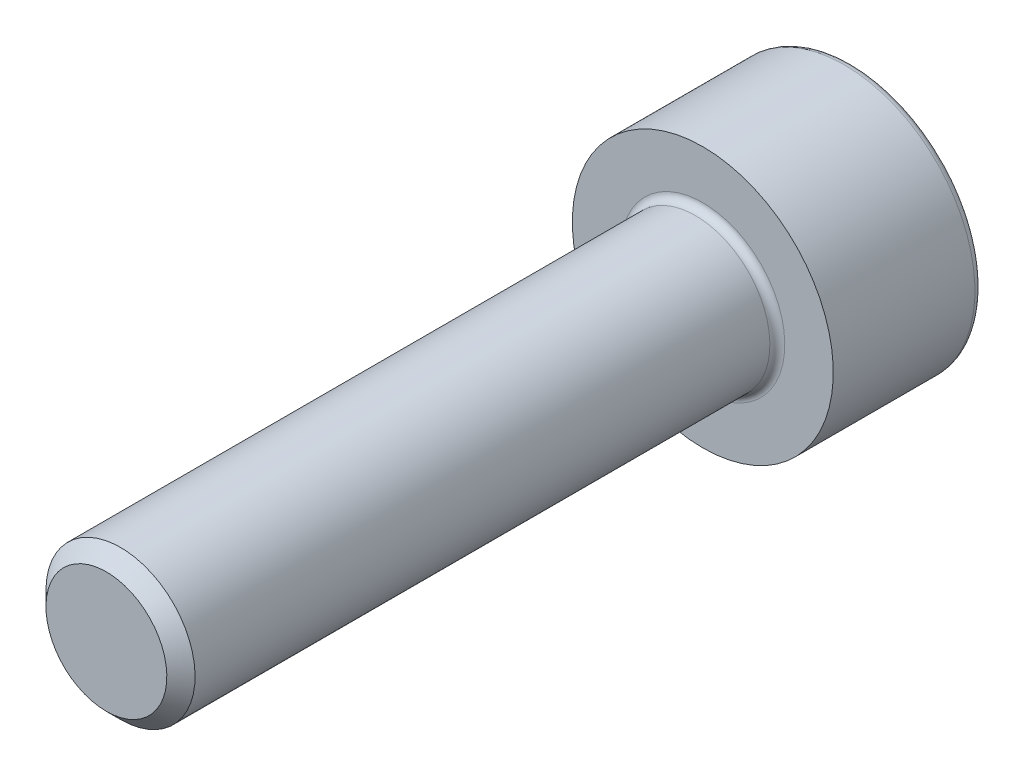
ISO-10303-21;
HEADER;
FILE_DESCRIPTION(('STEP AP214'),'2;1');
FILE_NAME('part.step','',(''),(''),'','','');
FILE_SCHEMA(('AUTOMOTIVE_DESIGN { 1 0 10303 214 1 1 1 1 }'));
ENDSEC;
DATA;
#1=APPLICATION_CONTEXT('core data for automotive mechanical design processes');
#2=APPLICATION_PROTOCOL_DEFINITION('international standard','automotive_design',2000,#1);
#3=PRODUCT_CONTEXT('',#1,'mechanical');
#4=PRODUCT('Part','Part','',(#3));
#5=PRODUCT_RELATED_PRODUCT_CATEGORY('part','',(#4));
#6=PRODUCT_DEFINITION_FORMATION('','',#4);
#7=PRODUCT_DEFINITION_CONTEXT('part definition',#1,'design');
#8=PRODUCT_DEFINITION('design','',#6,#7);
#9=PRODUCT_DEFINITION_SHAPE('','',#8);
#10=(LENGTH_UNIT() NAMED_UNIT(*) SI_UNIT(.MILLI.,.METRE.));
#11=(NAMED_UNIT(*) PLANE_ANGLE_UNIT() SI_UNIT($,.RADIAN.));
#12=(NAMED_UNIT(*) SI_UNIT($,.STERADIAN.) SOLID_ANGLE_UNIT());
#13=UNCERTAINTY_MEASURE_WITH_UNIT(LENGTH_MEASURE(1.E-05),#10,'distance_accuracy_value','');
#14=(GEOMETRIC_REPRESENTATION_CONTEXT(3) GLOBAL_UNCERTAINTY_ASSIGNED_CONTEXT((#13)) GLOBAL_UNIT_ASSIGNED_CONTEXT((#10,
#11,#12)) REPRESENTATION_CONTEXT('',''));
#15=CARTESIAN_POINT('',(0.,0.,0.));
#16=DIRECTION('',(0.,0.,1.));
#17=DIRECTION('',(1.,0.,0.));
#18=AXIS2_PLACEMENT_3D('',#15,#16,#17);
#19=CARTESIAN_POINT('',(0.,2.,16.));
#20=DIRECTION('',(0.,0.,1.));
#21=DIRECTION('',(0.,-1.,0.));
#22=AXIS2_PLACEMENT_3D('',#19,#20,#21);
#23=PLANE('',#22);
#24=CARTESIAN_POINT('',(0.,0.,16.));
#25=DIRECTION('',(0.,0.,1.));
#26=DIRECTION('',(0.,-1.,0.));
#27=AXIS2_PLACEMENT_3D('',#24,#25,#26);
#28=CIRCLE('',#27,1.621125);
#29=CARTESIAN_POINT('',(0.,-1.621125,16.));
#30=VERTEX_POINT('',#29);
#31=EDGE_CURVE('E11',#30,#30,#28,.T.);
#32=ORIENTED_EDGE('',*,*,#31,.T.);
#33=EDGE_LOOP('',(#32));
#34=FACE_BOUND('',#33,.T.);
#35=ADVANCED_FACE('F33',(#34),#23,.T.);
#36=CARTESIAN_POINT('',(0.,0.,-4.));
#37=DIRECTION('',(0.,0.,-1.));
#38=DIRECTION('',(0.,1.,0.));
#39=AXIS2_PLACEMENT_3D('',#36,#37,#38);
#40=CYLINDRICAL_SURFACE('',#39,2.);
#41=CARTESIAN_POINT('',(0.,0.,15.621125));
#42=DIRECTION('',(0.,0.,1.));
#43=DIRECTION('',(0.,-1.,0.));
#44=AXIS2_PLACEMENT_3D('',#41,#42,#43);
#45=CIRCLE('',#44,2.);
#46=CARTESIAN_POINT('',(0.,-2.,15.621125));
#47=VERTEX_POINT('',#46);
#48=EDGE_CURVE('E40',#47,#47,#45,.F.);
#49=ORIENTED_EDGE('',*,*,#48,.T.);
#50=EDGE_LOOP('',(#49));
#51=FACE_BOUND('',#50,.T.);
#52=CARTESIAN_POINT('',(0.,0.,0.2));
#53=DIRECTION('',(0.,0.,1.));
#54=DIRECTION('',(0.,-1.,0.));
#55=AXIS2_PLACEMENT_3D('',#52,#53,#54);
#56=CIRCLE('',#55,2.);
#57=CARTESIAN_POINT('',(0.,-2.,0.199999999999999));
#58=VERTEX_POINT('',#57);
#59=EDGE_CURVE('E183',#58,#58,#56,.T.);
#60=ORIENTED_EDGE('',*,*,#59,.T.);
#61=EDGE_LOOP('',(#60));
#62=FACE_BOUND('',#61,.T.);
#63=ADVANCED_FACE('F194',(#51,#62),#40,.T.);
#64=CARTESIAN_POINT('',(0.,3.5,0.));
#65=DIRECTION('',(0.,0.,1.));
#66=DIRECTION('',(0.,-1.,0.));
#67=AXIS2_PLACEMENT_3D('',#64,#65,#66);
#68=PLANE('',#67);
#69=CARTESIAN_POINT('',(0.,0.,0.));
#70=DIRECTION('',(0.,0.,1.));
#71=DIRECTION('',(0.,-1.,0.));
#72=AXIS2_PLACEMENT_3D('',#69,#70,#71);
#73=CIRCLE('',#72,2.2);
#74=CARTESIAN_POINT('',(0.,-2.2,0.));
#75=VERTEX_POINT('',#74);
#76=EDGE_CURVE('E180',#75,#75,#73,.F.);
#77=ORIENTED_EDGE('',*,*,#76,.T.);
#78=EDGE_LOOP('',(#77));
#79=FACE_BOUND('',#78,.T.);
#80=CARTESIAN_POINT('',(0.,0.,0.));
#81=DIRECTION('',(0.,0.,-1.));
#82=DIRECTION('',(0.,1.,0.));
#83=AXIS2_PLACEMENT_3D('',#80,#81,#82);
#84=CIRCLE('',#83,3.5);
#85=CARTESIAN_POINT('',(0.,3.5,0.));
#86=VERTEX_POINT('',#85);
#87=EDGE_CURVE('E176',#86,#86,#84,.T.);
#88=ORIENTED_EDGE('',*,*,#87,.F.);
#89=EDGE_LOOP('',(#88));
#90=FACE_BOUND('',#89,.T.);
#91=ADVANCED_FACE('F214',(#79,#90),#68,.T.);
#92=CARTESIAN_POINT('',(0.,0.,-4.));
#93=DIRECTION('',(0.,0.,-1.));
#94=DIRECTION('',(0.,1.,0.));
#95=AXIS2_PLACEMENT_3D('',#92,#93,#94);
#96=CYLINDRICAL_SURFACE('',#95,3.5);
#97=CARTESIAN_POINT('',(0.,0.,-3.8));
#98=DIRECTION('',(0.,0.,-1.));
#99=DIRECTION('',(0.,1.,0.));
#100=AXIS2_PLACEMENT_3D('',#97,#98,#99);
#101=CIRCLE('',#100,3.5);
#102=CARTESIAN_POINT('',(0.,3.5,-3.8));
#103=VERTEX_POINT('',#102);
#104=EDGE_CURVE('E189',#103,#103,#101,.F.);
#105=ORIENTED_EDGE('',*,*,#104,.T.);
#106=EDGE_LOOP('',(#105));
#107=FACE_BOUND('',#106,.T.);
#108=ORIENTED_EDGE('',*,*,#87,.T.);
#109=EDGE_LOOP('',(#108));
#110=FACE_BOUND('',#109,.T.);
#111=ADVANCED_FACE('F218',(#107,#110),#96,.T.);
#112=CARTESIAN_POINT('',(0.,0.,-4.));
#113=DIRECTION('',(0.,0.,-1.));
#114=DIRECTION('',(0.,1.,0.));
#115=AXIS2_PLACEMENT_3D('',#112,#113,#114);
#116=PLANE('',#115);
#117=CARTESIAN_POINT('',(0.,0.,-4.));
#118=DIRECTION('',(0.,0.,-1.));
#119=DIRECTION('',(0.,1.,0.));
#120=AXIS2_PLACEMENT_3D('',#117,#118,#119);
#121=CIRCLE('',#120,3.3);
#122=CARTESIAN_POINT('',(0.,3.3,-4.));
#123=VERTEX_POINT('',#122);
#124=EDGE_CURVE('E186',#123,#123,#121,.T.);
#125=ORIENTED_EDGE('',*,*,#124,.T.);
#126=EDGE_LOOP('',(#125));
#127=FACE_BOUND('',#126,.T.);
#128=DIRECTION('',(-1.,0.,0.));
#129=VECTOR('',#128,1.);
#130=CARTESIAN_POINT('',(0.866025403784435,-1.5,-4.));
#131=LINE('',#130,#129);
#132=CARTESIAN_POINT('',(0.866025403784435,-1.5,-4.));
#133=VERTEX_POINT('',#132);
#134=CARTESIAN_POINT('',(-0.86602540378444,-1.5,-4.));
#135=VERTEX_POINT('',#134);
#136=EDGE_CURVE('E138',#133,#135,#131,.T.);
#137=ORIENTED_EDGE('',*,*,#136,.F.);
#138=DIRECTION('',(-0.499999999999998,-0.86602540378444,0.));
#139=VECTOR('',#138,1.);
#140=CARTESIAN_POINT('',(1.73205080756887,0.,-4.));
#141=LINE('',#140,#139);
#142=CARTESIAN_POINT('',(1.73205080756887,0.,-4.));
#143=VERTEX_POINT('',#142);
#144=EDGE_CURVE('E133',#143,#133,#141,.T.);
#145=ORIENTED_EDGE('',*,*,#144,.F.);
#146=DIRECTION('',(0.499999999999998,-0.86602540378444,0.));
#147=VECTOR('',#146,1.);
#148=CARTESIAN_POINT('',(0.866025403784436,1.5,-4.));
#149=LINE('',#148,#147);
#150=CARTESIAN_POINT('',(0.866025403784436,1.5,-4.));
#151=VERTEX_POINT('',#150);
#152=EDGE_CURVE('E131',#151,#143,#149,.T.);
#153=ORIENTED_EDGE('',*,*,#152,.F.);
#154=DIRECTION('',(1.,0.,0.));
#155=VECTOR('',#154,1.);
#156=CARTESIAN_POINT('',(-0.866025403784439,1.5,-4.));
#157=LINE('',#156,#155);
#158=CARTESIAN_POINT('',(-0.866025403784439,1.5,-4.));
#159=VERTEX_POINT('',#158);
#160=EDGE_CURVE('E116',#159,#151,#157,.T.);
#161=ORIENTED_EDGE('',*,*,#160,.F.);
#162=DIRECTION('',(0.499999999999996,0.866025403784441,0.));
#163=VECTOR('',#162,1.);
#164=CARTESIAN_POINT('',(-1.73205080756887,0.,-4.));
#165=LINE('',#164,#163);
#166=CARTESIAN_POINT('',(-1.73205080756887,0.,-4.));
#167=VERTEX_POINT('',#166);
#168=EDGE_CURVE('E104',#167,#159,#165,.T.);
#169=ORIENTED_EDGE('',*,*,#168,.F.);
#170=DIRECTION('',(-0.499999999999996,0.866025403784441,0.));
#171=VECTOR('',#170,1.);
#172=CARTESIAN_POINT('',(-0.86602540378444,-1.5,-4.));
#173=LINE('',#172,#171);
#174=EDGE_CURVE('E140',#135,#167,#173,.T.);
#175=ORIENTED_EDGE('',*,*,#174,.F.);
#176=EDGE_LOOP('',(#137,#145,#153,#161,#169,#175));
#177=FACE_BOUND('',#176,.T.);
#178=ADVANCED_FACE('F129',(#127,#177),#116,.T.);
#179=CARTESIAN_POINT('',(-1.73205080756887,0.,-2.));
#180=DIRECTION('',(-0.866025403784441,0.499999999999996,0.));
#181=DIRECTION('',(-0.499999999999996,-0.866025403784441,0.));
#182=AXIS2_PLACEMENT_3D('',#179,#180,#181);
#183=PLANE('',#182);
#184=ORIENTED_EDGE('',*,*,#168,.T.);
#185=DIRECTION('',(0.,0.,-1.));
#186=VECTOR('',#185,1.);
#187=CARTESIAN_POINT('',(-0.866025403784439,1.5,-2.));
#188=LINE('',#187,#186);
#189=CARTESIAN_POINT('',(-0.866025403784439,1.5,-2.));
#190=VERTEX_POINT('',#189);
#191=EDGE_CURVE('E108',#190,#159,#188,.T.);
#192=ORIENTED_EDGE('',*,*,#191,.F.);
#193=DIRECTION('',(0.499999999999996,0.866025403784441,0.));
#194=VECTOR('',#193,1.);
#195=CARTESIAN_POINT('',(-1.73205080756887,0.,-2.));
#196=LINE('',#195,#194);
#197=CARTESIAN_POINT('',(-1.29903810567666,0.749999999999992,-2.));
#198=VERTEX_POINT('',#197);
#199=EDGE_CURVE('E142',#198,#190,#196,.T.);
#200=ORIENTED_EDGE('',*,*,#199,.F.);
#201=CARTESIAN_POINT('',(-1.73205080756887,0.,-2.));
#202=VERTEX_POINT('',#201);
#203=EDGE_CURVE('E143',#202,#198,#196,.T.);
#204=ORIENTED_EDGE('',*,*,#203,.F.);
#205=DIRECTION('',(0.,0.,-1.));
#206=VECTOR('',#205,1.);
#207=CARTESIAN_POINT('',(-1.73205080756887,0.,-2.));
#208=LINE('',#207,#206);
#209=EDGE_CURVE('E112',#202,#167,#208,.T.);
#210=ORIENTED_EDGE('',*,*,#209,.T.);
#211=EDGE_LOOP('',(#184,#192,#200,#204,#210));
#212=FACE_BOUND('',#211,.T.);
#213=ADVANCED_FACE('F106',(#212),#183,.F.);
#214=CARTESIAN_POINT('',(-0.86602540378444,-1.5,-2.));
#215=DIRECTION('',(-0.866025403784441,-0.499999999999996,0.));
#216=DIRECTION('',(0.499999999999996,-0.866025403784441,0.));
#217=AXIS2_PLACEMENT_3D('',#214,#215,#216);
#218=PLANE('',#217);
#219=ORIENTED_EDGE('',*,*,#174,.T.);
#220=ORIENTED_EDGE('',*,*,#209,.F.);
#221=DIRECTION('',(-0.499999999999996,0.866025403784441,0.));
#222=VECTOR('',#221,1.);
#223=CARTESIAN_POINT('',(-0.86602540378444,-1.5,-2.));
#224=LINE('',#223,#222);
#225=CARTESIAN_POINT('',(-1.29903810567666,-0.749999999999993,-2.));
#226=VERTEX_POINT('',#225);
#227=EDGE_CURVE('E158',#226,#202,#224,.T.);
#228=ORIENTED_EDGE('',*,*,#227,.F.);
#229=CARTESIAN_POINT('',(-0.86602540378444,-1.5,-2.));
#230=VERTEX_POINT('',#229);
#231=EDGE_CURVE('E126',#230,#226,#224,.T.);
#232=ORIENTED_EDGE('',*,*,#231,.F.);
#233=DIRECTION('',(0.,0.,-1.));
#234=VECTOR('',#233,1.);
#235=CARTESIAN_POINT('',(-0.86602540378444,-1.5,-2.));
#236=LINE('',#235,#234);
#237=EDGE_CURVE('E163',#230,#135,#236,.T.);
#238=ORIENTED_EDGE('',*,*,#237,.T.);
#239=EDGE_LOOP('',(#219,#220,#228,#232,#238));
#240=FACE_BOUND('',#239,.T.);
#241=ADVANCED_FACE('F234',(#240),#218,.F.);
#242=CARTESIAN_POINT('',(0.866025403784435,-1.5,-2.));
#243=DIRECTION('',(0.,-1.,0.));
#244=DIRECTION('',(0.,0.,-1.));
#245=AXIS2_PLACEMENT_3D('',#242,#243,#244);
#246=PLANE('',#245);
#247=ORIENTED_EDGE('',*,*,#136,.T.);
#248=ORIENTED_EDGE('',*,*,#237,.F.);
#249=DIRECTION('',(-1.,0.,0.));
#250=VECTOR('',#249,1.);
#251=CARTESIAN_POINT('',(0.866025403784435,-1.5,-2.));
#252=LINE('',#251,#250);
#253=CARTESIAN_POINT('',(0.,-1.5,-2.));
#254=VERTEX_POINT('',#253);
#255=EDGE_CURVE('E156',#254,#230,#252,.T.);
#256=ORIENTED_EDGE('',*,*,#255,.F.);
#257=CARTESIAN_POINT('',(0.866025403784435,-1.5,-2.));
#258=VERTEX_POINT('',#257);
#259=EDGE_CURVE('E47',#258,#254,#252,.T.);
#260=ORIENTED_EDGE('',*,*,#259,.F.);
#261=DIRECTION('',(0.,0.,-1.));
#262=VECTOR('',#261,1.);
#263=CARTESIAN_POINT('',(0.866025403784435,-1.5,-2.));
#264=LINE('',#263,#262);
#265=EDGE_CURVE('E166',#258,#133,#264,.T.);
#266=ORIENTED_EDGE('',*,*,#265,.T.);
#267=EDGE_LOOP('',(#247,#248,#256,#260,#266));
#268=FACE_BOUND('',#267,.T.);
#269=ADVANCED_FACE('F245',(#268),#246,.F.);
#270=CARTESIAN_POINT('',(1.73205080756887,0.,-2.));
#271=DIRECTION('',(0.86602540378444,-0.499999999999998,0.));
#272=DIRECTION('',(0.499999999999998,0.86602540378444,0.));
#273=AXIS2_PLACEMENT_3D('',#270,#271,#272);
#274=PLANE('',#273);
#275=ORIENTED_EDGE('',*,*,#144,.T.);
#276=ORIENTED_EDGE('',*,*,#265,.F.);
#277=DIRECTION('',(-0.499999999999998,-0.86602540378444,0.));
#278=VECTOR('',#277,1.);
#279=CARTESIAN_POINT('',(1.73205080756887,0.,-2.));
#280=LINE('',#279,#278);
#281=CARTESIAN_POINT('',(1.29903810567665,-0.749999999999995,-2.));
#282=VERTEX_POINT('',#281);
#283=EDGE_CURVE('E152',#282,#258,#280,.T.);
#284=ORIENTED_EDGE('',*,*,#283,.F.);
#285=CARTESIAN_POINT('',(1.73205080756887,0.,-2.));
#286=VERTEX_POINT('',#285);
#287=EDGE_CURVE('E153',#286,#282,#280,.T.);
#288=ORIENTED_EDGE('',*,*,#287,.F.);
#289=DIRECTION('',(0.,0.,-1.));
#290=VECTOR('',#289,1.);
#291=CARTESIAN_POINT('',(1.73205080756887,0.,-2.));
#292=LINE('',#291,#290);
#293=EDGE_CURVE('E169',#286,#143,#292,.T.);
#294=ORIENTED_EDGE('',*,*,#293,.T.);
#295=EDGE_LOOP('',(#275,#276,#284,#288,#294));
#296=FACE_BOUND('',#295,.T.);
#297=ADVANCED_FACE('F241',(#296),#274,.F.);
#298=CARTESIAN_POINT('',(0.866025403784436,1.5,-2.));
#299=DIRECTION('',(0.86602540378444,0.499999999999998,0.));
#300=DIRECTION('',(-0.499999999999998,0.86602540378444,0.));
#301=AXIS2_PLACEMENT_3D('',#298,#299,#300);
#302=PLANE('',#301);
#303=ORIENTED_EDGE('',*,*,#152,.T.);
#304=ORIENTED_EDGE('',*,*,#293,.F.);
#305=DIRECTION('',(0.499999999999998,-0.86602540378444,0.));
#306=VECTOR('',#305,1.);
#307=CARTESIAN_POINT('',(0.866025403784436,1.5,-2.));
#308=LINE('',#307,#306);
#309=CARTESIAN_POINT('',(1.29903810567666,0.749999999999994,-2.));
#310=VERTEX_POINT('',#309);
#311=EDGE_CURVE('E148',#310,#286,#308,.T.);
#312=ORIENTED_EDGE('',*,*,#311,.F.);
#313=CARTESIAN_POINT('',(0.866025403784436,1.5,-2.));
#314=VERTEX_POINT('',#313);
#315=EDGE_CURVE('E149',#314,#310,#308,.T.);
#316=ORIENTED_EDGE('',*,*,#315,.F.);
#317=DIRECTION('',(0.,0.,-1.));
#318=VECTOR('',#317,1.);
#319=CARTESIAN_POINT('',(0.866025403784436,1.5,-2.));
#320=LINE('',#319,#318);
#321=EDGE_CURVE('E125',#314,#151,#320,.T.);
#322=ORIENTED_EDGE('',*,*,#321,.T.);
#323=EDGE_LOOP('',(#303,#304,#312,#316,#322));
#324=FACE_BOUND('',#323,.T.);
#325=ADVANCED_FACE('F238',(#324),#302,.F.);
#326=CARTESIAN_POINT('',(-0.866025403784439,1.5,-2.));
#327=DIRECTION('',(0.,1.,0.));
#328=DIRECTION('',(0.,0.,1.));
#329=AXIS2_PLACEMENT_3D('',#326,#327,#328);
#330=PLANE('',#329);
#331=ORIENTED_EDGE('',*,*,#160,.T.);
#332=ORIENTED_EDGE('',*,*,#321,.F.);
#333=DIRECTION('',(1.,0.,0.));
#334=VECTOR('',#333,1.);
#335=CARTESIAN_POINT('',(-0.866025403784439,1.5,-2.));
#336=LINE('',#335,#334);
#337=CARTESIAN_POINT('',(0.,1.5,-2.));
#338=VERTEX_POINT('',#337);
#339=EDGE_CURVE('E146',#338,#314,#336,.T.);
#340=ORIENTED_EDGE('',*,*,#339,.F.);
#341=EDGE_CURVE('E124',#190,#338,#336,.T.);
#342=ORIENTED_EDGE('',*,*,#341,.F.);
#343=ORIENTED_EDGE('',*,*,#191,.T.);
#344=EDGE_LOOP('',(#331,#332,#340,#342,#343));
#345=FACE_BOUND('',#344,.T.);
#346=ADVANCED_FACE('F119',(#345),#330,.F.);
#347=CARTESIAN_POINT('',(-2.5980762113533,-1.5,-2.));
#348=DIRECTION('',(0.,0.,1.));
#349=DIRECTION('',(0.,-1.,0.));
#350=AXIS2_PLACEMENT_3D('',#347,#348,#349);
#351=PLANE('',#350);
#352=ORIENTED_EDGE('',*,*,#255,.T.);
#353=ORIENTED_EDGE('',*,*,#231,.T.);
#354=CARTESIAN_POINT('',(0.,0.,-2.));
#355=DIRECTION('',(0.,0.,-1.));
#356=DIRECTION('',(0.,1.,0.));
#357=AXIS2_PLACEMENT_3D('',#354,#355,#356);
#358=CIRCLE('',#357,1.5);
#359=EDGE_CURVE('E405',#254,#226,#358,.T.);
#360=ORIENTED_EDGE('',*,*,#359,.F.);
#361=EDGE_LOOP('',(#352,#353,#360));
#362=FACE_BOUND('',#361,.T.);
#363=ADVANCED_FACE('F237',(#362),#351,.F.);
#364=ORIENTED_EDGE('',*,*,#227,.T.);
#365=ORIENTED_EDGE('',*,*,#203,.T.);
#366=EDGE_CURVE('E401',#226,#198,#358,.T.);
#367=ORIENTED_EDGE('',*,*,#366,.F.);
#368=EDGE_LOOP('',(#364,#365,#367));
#369=FACE_BOUND('',#368,.T.);
#370=ADVANCED_FACE('F255',(#369),#351,.F.);
#371=ORIENTED_EDGE('',*,*,#199,.T.);
#372=ORIENTED_EDGE('',*,*,#341,.T.);
#373=EDGE_CURVE('E162',#198,#338,#358,.T.);
#374=ORIENTED_EDGE('',*,*,#373,.F.);
#375=EDGE_LOOP('',(#371,#372,#374));
#376=FACE_BOUND('',#375,.T.);
#377=ADVANCED_FACE('F304',(#376),#351,.F.);
#378=ORIENTED_EDGE('',*,*,#339,.T.);
#379=ORIENTED_EDGE('',*,*,#315,.T.);
#380=EDGE_CURVE('E173',#338,#310,#358,.T.);
#381=ORIENTED_EDGE('',*,*,#380,.F.);
#382=EDGE_LOOP('',(#378,#379,#381));
#383=FACE_BOUND('',#382,.T.);
#384=ADVANCED_FACE('F296',(#383),#351,.F.);
#385=ORIENTED_EDGE('',*,*,#311,.T.);
#386=ORIENTED_EDGE('',*,*,#287,.T.);
#387=EDGE_CURVE('E177',#310,#282,#358,.T.);
#388=ORIENTED_EDGE('',*,*,#387,.F.);
#389=EDGE_LOOP('',(#385,#386,#388));
#390=FACE_BOUND('',#389,.T.);
#391=ADVANCED_FACE('F289',(#390),#351,.F.);
#392=ORIENTED_EDGE('',*,*,#283,.T.);
#393=ORIENTED_EDGE('',*,*,#259,.T.);
#394=EDGE_CURVE('E407',#282,#254,#358,.T.);
#395=ORIENTED_EDGE('',*,*,#394,.F.);
#396=EDGE_LOOP('',(#392,#393,#395));
#397=FACE_BOUND('',#396,.T.);
#398=ADVANCED_FACE('F231',(#397),#351,.F.);
#399=CARTESIAN_POINT('',(0.,0.,-2.));
#400=DIRECTION('',(0.,0.,-1.));
#401=DIRECTION('',(0.,1.,0.));
#402=AXIS2_PLACEMENT_3D('',#399,#400,#401);
#403=CONICAL_SURFACE('',#402,1.5,1.0471975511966);
#404=CARTESIAN_POINT('',(0.,0.,-1.13397459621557));
#405=VERTEX_POINT('',#404);
#406=VERTEX_LOOP('',#405);
#407=FACE_BOUND('',#406,.T.);
#408=ORIENTED_EDGE('',*,*,#380,.T.);
#409=ORIENTED_EDGE('',*,*,#387,.T.);
#410=ORIENTED_EDGE('',*,*,#394,.T.);
#411=ORIENTED_EDGE('',*,*,#359,.T.);
#412=ORIENTED_EDGE('',*,*,#366,.T.);
#413=ORIENTED_EDGE('',*,*,#373,.T.);
#414=EDGE_LOOP('',(#408,#409,#410,#411,#412,#413));
#415=FACE_BOUND('',#414,.T.);
#416=ADVANCED_FACE('F228',(#407,#415),#403,.F.);
#417=CARTESIAN_POINT('',(0.,0.,0.2));
#418=DIRECTION('',(0.,0.,1.));
#419=DIRECTION('',(0.,-1.,0.));
#420=AXIS2_PLACEMENT_3D('',#417,#418,#419);
#421=TOROIDAL_SURFACE('',#420,2.2,0.2);
#422=ORIENTED_EDGE('',*,*,#59,.F.);
#423=EDGE_LOOP('',(#422));
#424=FACE_BOUND('',#423,.T.);
#425=ORIENTED_EDGE('',*,*,#76,.F.);
#426=EDGE_LOOP('',(#425));
#427=FACE_BOUND('',#426,.T.);
#428=ADVANCED_FACE('F205',(#424,#427),#421,.F.);
#429=CARTESIAN_POINT('',(0.,0.,-3.8));
#430=DIRECTION('',(0.,0.,-1.));
#431=DIRECTION('',(0.,1.,0.));
#432=AXIS2_PLACEMENT_3D('',#429,#430,#431);
#433=TOROIDAL_SURFACE('',#432,3.3,0.2);
#434=ORIENTED_EDGE('',*,*,#104,.F.);
#435=EDGE_LOOP('',(#434));
#436=FACE_BOUND('',#435,.T.);
#437=ORIENTED_EDGE('',*,*,#124,.F.);
#438=EDGE_LOOP('',(#437));
#439=FACE_BOUND('',#438,.T.);
#440=ADVANCED_FACE('F199',(#436,#439),#433,.T.);
#441=CARTESIAN_POINT('',(0.,0.,15.621125));
#442=DIRECTION('',(0.,0.,-1.));
#443=DIRECTION('',(0.,1.,0.));
#444=AXIS2_PLACEMENT_3D('',#441,#442,#443);
#445=CONICAL_SURFACE('',#444,2.,0.785398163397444);
#446=ORIENTED_EDGE('',*,*,#31,.F.);
#447=EDGE_LOOP('',(#446));
#448=FACE_BOUND('',#447,.T.);
#449=ORIENTED_EDGE('',*,*,#48,.F.);
#450=EDGE_LOOP('',(#449));
#451=FACE_BOUND('',#450,.T.);
#452=ADVANCED_FACE('F197',(#448,#451),#445,.T.);
#453=CLOSED_SHELL('',(#35,#63,#91,#111,#178,#213,#241,#269,#297,#325,#346,#363,#370,#377,#384,
#391,#398,#416,#428,#440,#452));
#454=MANIFOLD_SOLID_BREP('B2',#453);
#455=ADVANCED_BREP_SHAPE_REPRESENTATION('',(#18,#454),#14);
#456=SHAPE_DEFINITION_REPRESENTATION(#9,#455);
ENDSEC;
END-ISO-10303-21;
